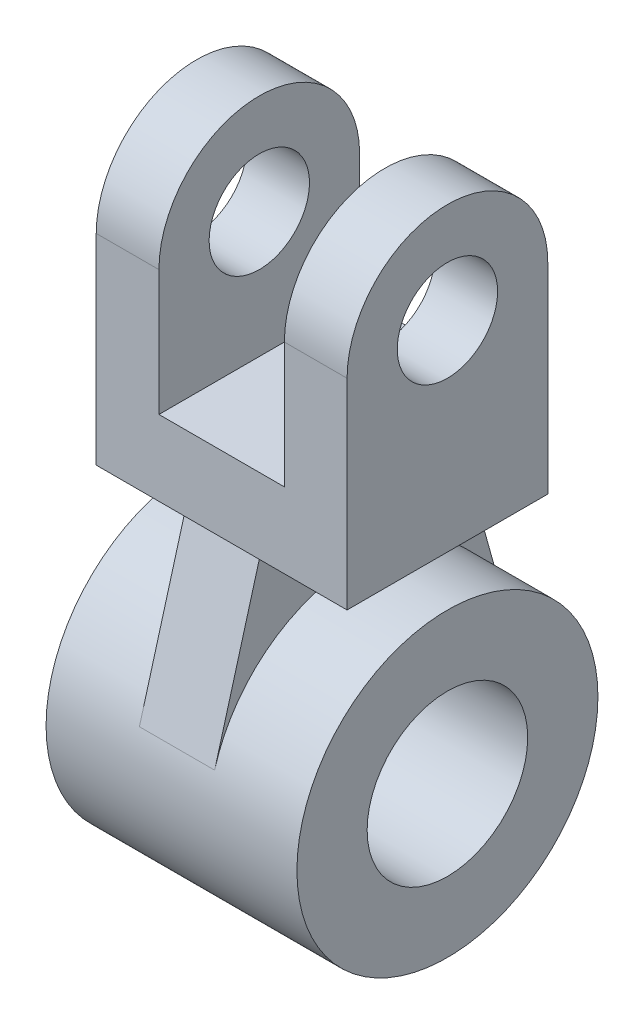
from build123d import *

# Parameters (mm, degrees)
SKETCH1_R           = 30
BOSS_EXTRUDE1_DEPTH = 50
SKETCH2_R           = 16
CUT_EXTRUDE1_DEPTH  = 66.574385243
BOSS_EXTRUDE2_DEPTH = 12.5
SKETCH4_R           = 10
CUT_EXTRUDE2_DEPTH  = 12.5
BOSS_EXTRUDE3_DEPTH = 12.5
SKETCH6_R           = 10
CUT_EXTRUDE3_DEPTH  = 12.5
SKETCH7_W           = 25
SKETCH7_H           = 15
BOSS_EXTRUDE4_DEPTH = 40
BOSS_EXTRUDE5_DEPTH = 7.5


with BuildPart() as part:
    # Sketch1 → Boss-Extrude1 (new body)
    with BuildSketch(Plane(origin=(0, 0, 0), x_dir=(0, 0, -1), z_dir=(1, 0, 0))):
        Circle(SKETCH1_R)
    extrude(amount=-BOSS_EXTRUDE1_DEPTH)

    # Sketch2 → Cut-Extrude1 (cut, through all)
    with BuildSketch(Plane(origin=(0, 0, 0), x_dir=(0, 0, -1), z_dir=(1, 0, 0))):
        Circle(SKETCH2_R)
    extrude(amount=-CUT_EXTRUDE1_DEPTH, mode=Mode.SUBTRACT)



with BuildPart() as body_2:
    # Sketch3 → Boss-Extrude2 (new body)
    with BuildSketch(Plane(origin=(0, 0, 0), x_dir=(0, 0, -1), z_dir=(1, 0, 0))):
        with BuildLine():
            Line((20, 80), (20, 40))
            Line((20, 40), (-20, 40))
            Line((-20, 40), (-20, 80))
            ThreePointArc((-20, 80), (0, 100), (20, 80))
        make_face()
    extrude(amount=-BOSS_EXTRUDE2_DEPTH)

    # Sketch4 → Cut-Extrude2 (cut)
    with BuildSketch(Plane(origin=(0, 0, 0), x_dir=(0, 0, -1), z_dir=(1, 0, 0))):
        with Locations((0, 80)):
            Circle(SKETCH4_R)
    extrude(amount=-CUT_EXTRUDE2_DEPTH, mode=Mode.SUBTRACT)



with BuildPart() as body_3:
    # Sketch5 → Boss-Extrude3 (new body)
    with BuildSketch(Plane.ZY.offset(50)):
        with BuildLine():
            Line((-20, 80), (-20, 40))
            Line((-20, 40), (20, 40))
            Line((20, 40), (20, 80))
            ThreePointArc((20, 80), (0, 100), (-20, 80))
        make_face()
    extrude(amount=-BOSS_EXTRUDE3_DEPTH)

    # Sketch6 → Cut-Extrude3 (cut)
    with BuildSketch(Plane.ZY.offset(50)):
        with Locations(Location((0, 80, 0), (0, 0, 180))):
            Circle(SKETCH6_R)
    extrude(amount=-CUT_EXTRUDE3_DEPTH, mode=Mode.SUBTRACT)


with BuildPart() as body_2_1:
    add(body_2.part)

    add(body_3.part)  # Boss-Extrude4 merges body 3
    # Sketch7 → Boss-Extrude4 (add)
    with BuildSketch(Plane.XY.offset(20)):
        with Locations((-25, 47.5)):
            Rectangle(SKETCH7_W, SKETCH7_H)
    extrude(amount=-BOSS_EXTRUDE4_DEPTH)


with BuildPart() as part_1:
    add(part.part)

    add(body_2_1.part)  # Boss-Extrude5 merges body 2
    # Sketch8 → Boss-Extrude5 (add, symmetric)
    with BuildSketch(Plane.ZY.offset(25)):
        with BuildLine():
            Line((-20, 40), (-28.899748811, 8.05012538))
            ThreePointArc((-28.899748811, 8.05012538), (-1.29e-07, 30), (28.899748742, 8.050125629))
            Line((28.899748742, 8.050125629), (20, 40))
            Line((20, 40), (-20, 40))
        make_face()
    extrude(amount=BOSS_EXTRUDE5_DEPTH, both=True)


solid = part_1.part
